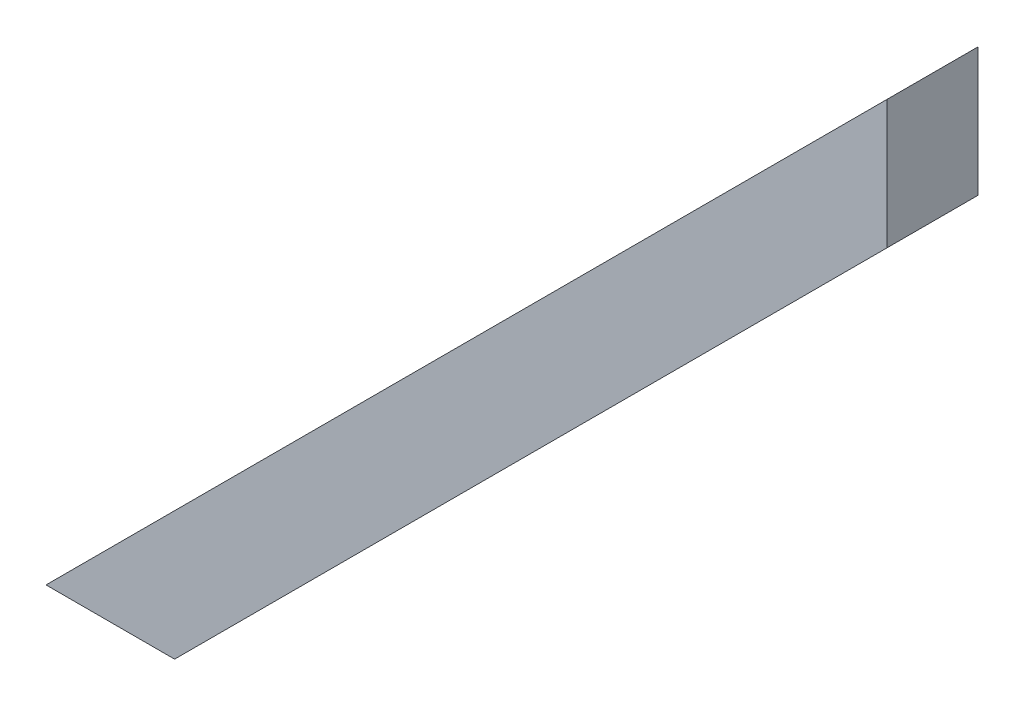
from build123d import *

# Parameters (mm, degrees)
BOSS_EXTRU_1_DEPTH = 40


with BuildPart() as part:
    # Esquisse1 → Boss.-Extru.1 (new body)
    with BuildSketch(Plane.XY):
        Polygon((410, 353.431457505), (96.568542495, 40), (40, 40), (410, 410), align=None)
    extrude(amount=-BOSS_EXTRU_1_DEPTH)


solid = part.part
